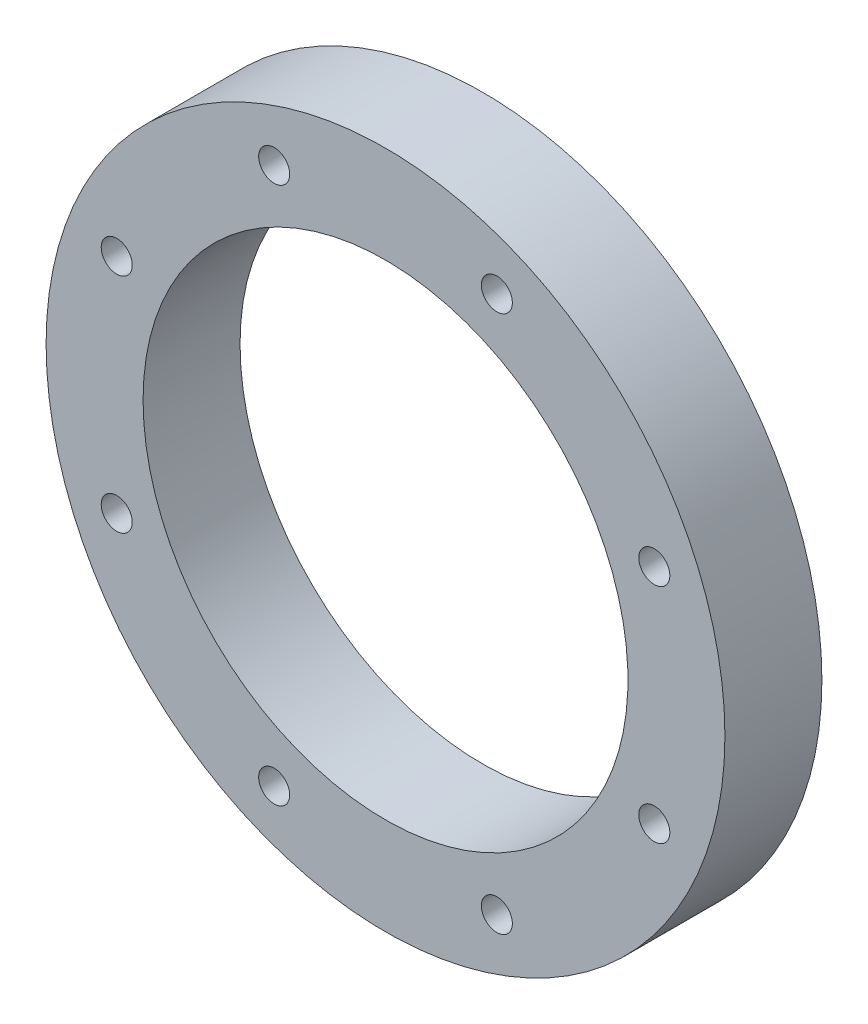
from build123d import *

# Parameters (mm, degrees)
SKETCH2_R                      = 35
BOSS_EXTRUDE1_DEPTH            = 10
SKETCH3_R                      = 25
CUT_EXTRUDE1_DEPTH             = 10
CBORE_FOR_M3_SHCS2_D           = 3.2
CBORE_FOR_M3_SHCS2_CBORE_D     = 6.5
CBORE_FOR_M3_SHCS2_CBORE_DEPTH = 4
CIRPATTERN1_COUNT              = 8


with BuildPart() as part:
    # Sketch2 → Boss-Extrude1 (new body)
    with BuildSketch(Plane.XY):
        Circle(SKETCH2_R)
    extrude(amount=-BOSS_EXTRUDE1_DEPTH)

    # Sketch3 → Cut-Extrude1 (cut)
    with BuildSketch(Plane(origin=(0, 0, -10), x_dir=(-1, 0, 0), z_dir=(0, 0, -1))):
        Circle(SKETCH3_R)
    extrude(amount=-CUT_EXTRUDE1_DEPTH, mode=Mode.SUBTRACT)

    # CBORE for M3 SHCS2 (through all)
    with Locations(Plane(origin=(0, 0, -10), x_dir=(-1, 0, 0), z_dir=(0, 0, -1))):
        with Locations((11.4805, 27.716387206)):
            cbore_for_m3_shcs2 = CounterBoreHole(CBORE_FOR_M3_SHCS2_D / 2, CBORE_FOR_M3_SHCS2_CBORE_D / 2, CBORE_FOR_M3_SHCS2_CBORE_DEPTH)

    # CirPattern1: CBORE for M3 SHCS2 ×8 about axis
    cirpattern1_axis = Axis((0, 0, 0), (0, 0, 1))
    for i in range(1, CIRPATTERN1_COUNT):
        add(cbore_for_m3_shcs2.rotate(cirpattern1_axis, i * 360 / CIRPATTERN1_COUNT), mode=Mode.SUBTRACT)


solid = part.part
